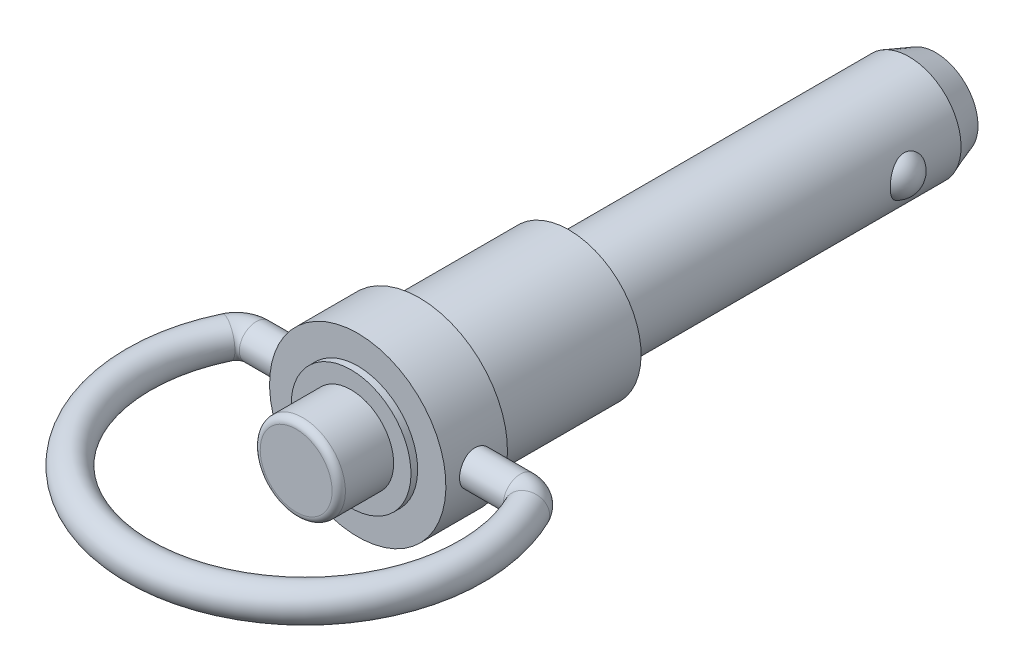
ISO-10303-21;
HEADER;
FILE_DESCRIPTION(('STEP AP214'),'2;1');
FILE_NAME('part.step','',(''),(''),'','','');
FILE_SCHEMA(('AUTOMOTIVE_DESIGN { 1 0 10303 214 1 1 1 1 }'));
ENDSEC;
DATA;
#1=APPLICATION_CONTEXT('core data for automotive mechanical design processes');
#2=APPLICATION_PROTOCOL_DEFINITION('international standard','automotive_design',2000,#1);
#3=PRODUCT_CONTEXT('',#1,'mechanical');
#4=PRODUCT('Part','Part','',(#3));
#5=PRODUCT_RELATED_PRODUCT_CATEGORY('part','',(#4));
#6=PRODUCT_DEFINITION_FORMATION('','',#4);
#7=PRODUCT_DEFINITION_CONTEXT('part definition',#1,'design');
#8=PRODUCT_DEFINITION('design','',#6,#7);
#9=PRODUCT_DEFINITION_SHAPE('','',#8);
#10=(LENGTH_UNIT() NAMED_UNIT(*) SI_UNIT(.MILLI.,.METRE.));
#11=(NAMED_UNIT(*) PLANE_ANGLE_UNIT() SI_UNIT($,.RADIAN.));
#12=(NAMED_UNIT(*) SI_UNIT($,.STERADIAN.) SOLID_ANGLE_UNIT());
#13=UNCERTAINTY_MEASURE_WITH_UNIT(LENGTH_MEASURE(1.E-05),#10,'distance_accuracy_value','');
#14=(GEOMETRIC_REPRESENTATION_CONTEXT(3) GLOBAL_UNCERTAINTY_ASSIGNED_CONTEXT((#13)) GLOBAL_UNIT_ASSIGNED_CONTEXT((#10,
#11,#12)) REPRESENTATION_CONTEXT('',''));
#15=CARTESIAN_POINT('',(0.,0.,0.));
#16=DIRECTION('',(0.,0.,1.));
#17=DIRECTION('',(1.,0.,0.));
#18=AXIS2_PLACEMENT_3D('',#15,#16,#17);
#19=CARTESIAN_POINT('',(0.,0.,20.828));
#20=DIRECTION('',(0.,0.,1.));
#21=DIRECTION('',(0.,-1.,0.));
#22=AXIS2_PLACEMENT_3D('',#19,#20,#21);
#23=PLANE('',#22);
#24=CARTESIAN_POINT('',(0.,0.,20.828));
#25=DIRECTION('',(0.,0.,-1.));
#26=DIRECTION('',(0.,1.,0.));
#27=AXIS2_PLACEMENT_3D('',#24,#25,#26);
#28=CIRCLE('',#27,2.7432);
#29=CARTESIAN_POINT('',(0.,2.7432,20.828));
#30=VERTEX_POINT('',#29);
#31=CARTESIAN_POINT('',(0.,-2.7432,20.828));
#32=VERTEX_POINT('',#31);
#33=EDGE_CURVE('E35',#30,#32,#28,.T.);
#34=ORIENTED_EDGE('',*,*,#33,.F.);
#35=CARTESIAN_POINT('',(0.,0.,20.828));
#36=DIRECTION('',(0.,0.,-1.));
#37=DIRECTION('',(0.,-1.,0.));
#38=AXIS2_PLACEMENT_3D('',#35,#36,#37);
#39=CIRCLE('',#38,2.7432);
#40=EDGE_CURVE('E28',#32,#30,#39,.T.);
#41=ORIENTED_EDGE('',*,*,#40,.F.);
#42=EDGE_LOOP('',(#34,#41));
#43=FACE_BOUND('',#42,.T.);
#44=ADVANCED_FACE('F14',(#43),#23,.T.);
#45=CARTESIAN_POINT('',(0.,0.,20.32));
#46=DIRECTION('',(0.,0.,1.));
#47=DIRECTION('',(0.,-1.,0.));
#48=AXIS2_PLACEMENT_3D('',#45,#46,#47);
#49=TOROIDAL_SURFACE('',#48,2.7432,0.508);
#50=ORIENTED_EDGE('',*,*,#40,.T.);
#51=ORIENTED_EDGE('',*,*,#33,.T.);
#52=EDGE_LOOP('',(#50,#51));
#53=FACE_BOUND('',#52,.T.);
#54=CARTESIAN_POINT('',(0.,0.,20.32));
#55=DIRECTION('',(0.,0.,-1.));
#56=DIRECTION('',(0.,1.,0.));
#57=AXIS2_PLACEMENT_3D('',#54,#55,#56);
#58=CIRCLE('',#57,3.2512);
#59=CARTESIAN_POINT('',(0.,3.2512,20.32));
#60=VERTEX_POINT('',#59);
#61=EDGE_CURVE('E114',#60,#60,#58,.T.);
#62=ORIENTED_EDGE('',*,*,#61,.F.);
#63=EDGE_LOOP('',(#62));
#64=FACE_BOUND('',#63,.T.);
#65=ADVANCED_FACE('F33',(#53,#64),#49,.T.);
#66=CARTESIAN_POINT('',(0.,0.,20.828));
#67=DIRECTION('',(0.,0.,-1.));
#68=DIRECTION('',(0.,1.,0.));
#69=AXIS2_PLACEMENT_3D('',#66,#67,#68);
#70=CYLINDRICAL_SURFACE('',#69,3.2512);
#71=CARTESIAN_POINT('',(0.,0.,16.637));
#72=DIRECTION('',(0.,0.,-1.));
#73=DIRECTION('',(0.,1.,0.));
#74=AXIS2_PLACEMENT_3D('',#71,#72,#73);
#75=CIRCLE('',#74,3.2512);
#76=CARTESIAN_POINT('',(0.,3.2512,16.637));
#77=VERTEX_POINT('',#76);
#78=EDGE_CURVE('E107',#77,#77,#75,.T.);
#79=ORIENTED_EDGE('',*,*,#78,.F.);
#80=EDGE_LOOP('',(#79));
#81=FACE_BOUND('',#80,.T.);
#82=ORIENTED_EDGE('',*,*,#61,.T.);
#83=EDGE_LOOP('',(#82));
#84=FACE_BOUND('',#83,.T.);
#85=ADVANCED_FACE('F90',(#81,#84),#70,.T.);
#86=CARTESIAN_POINT('',(4.572,0.,16.637));
#87=DIRECTION('',(0.,0.,1.));
#88=DIRECTION('',(0.,-1.,0.));
#89=AXIS2_PLACEMENT_3D('',#86,#87,#88);
#90=PLANE('',#89);
#91=ORIENTED_EDGE('',*,*,#78,.T.);
#92=EDGE_LOOP('',(#91));
#93=FACE_BOUND('',#92,.T.);
#94=CARTESIAN_POINT('',(0.,0.,16.637));
#95=DIRECTION('',(0.,0.,-1.));
#96=DIRECTION('',(0.,1.,0.));
#97=AXIS2_PLACEMENT_3D('',#94,#95,#96);
#98=CIRCLE('',#97,4.572);
#99=CARTESIAN_POINT('',(0.,4.572,16.637));
#100=VERTEX_POINT('',#99);
#101=EDGE_CURVE('E106',#100,#100,#98,.T.);
#102=ORIENTED_EDGE('',*,*,#101,.F.);
#103=EDGE_LOOP('',(#102));
#104=FACE_BOUND('',#103,.T.);
#105=ADVANCED_FACE('F93',(#93,#104),#90,.T.);
#106=CARTESIAN_POINT('',(0.,0.,0.));
#107=DIRECTION('',(0.,0.,-1.));
#108=DIRECTION('',(0.,1.,0.));
#109=AXIS2_PLACEMENT_3D('',#106,#107,#108);
#110=CYLINDRICAL_SURFACE('',#109,4.572);
#111=ORIENTED_EDGE('',*,*,#101,.T.);
#112=EDGE_LOOP('',(#111));
#113=FACE_BOUND('',#112,.T.);
#114=CARTESIAN_POINT('',(0.,0.,16.129));
#115=DIRECTION('',(0.,0.,-1.));
#116=DIRECTION('',(0.,1.,0.));
#117=AXIS2_PLACEMENT_3D('',#114,#115,#116);
#118=CIRCLE('',#117,4.572);
#119=CARTESIAN_POINT('',(0.,4.572,16.129));
#120=VERTEX_POINT('',#119);
#121=EDGE_CURVE('E134',#120,#120,#118,.T.);
#122=ORIENTED_EDGE('',*,*,#121,.F.);
#123=EDGE_LOOP('',(#122));
#124=FACE_BOUND('',#123,.T.);
#125=ADVANCED_FACE('F164',(#113,#124),#110,.T.);
#126=CARTESIAN_POINT('',(6.731,0.,16.129));
#127=DIRECTION('',(0.,0.,1.));
#128=DIRECTION('',(0.,-1.,0.));
#129=AXIS2_PLACEMENT_3D('',#126,#127,#128);
#130=PLANE('',#129);
#131=CARTESIAN_POINT('',(0.,0.,16.129));
#132=DIRECTION('',(0.,0.,-1.));
#133=DIRECTION('',(0.,1.,0.));
#134=AXIS2_PLACEMENT_3D('',#131,#132,#133);
#135=CIRCLE('',#134,6.731);
#136=CARTESIAN_POINT('',(0.,6.731,16.129));
#137=VERTEX_POINT('',#136);
#138=EDGE_CURVE('E131',#137,#137,#135,.T.);
#139=ORIENTED_EDGE('',*,*,#138,.F.);
#140=EDGE_LOOP('',(#139));
#141=FACE_BOUND('',#140,.T.);
#142=ORIENTED_EDGE('',*,*,#121,.T.);
#143=EDGE_LOOP('',(#142));
#144=FACE_BOUND('',#143,.T.);
#145=ADVANCED_FACE('F171',(#141,#144),#130,.T.);
#146=CARTESIAN_POINT('',(0.,0.,0.));
#147=DIRECTION('',(0.,0.,-1.));
#148=DIRECTION('',(0.,1.,0.));
#149=AXIS2_PLACEMENT_3D('',#146,#147,#148);
#150=CYLINDRICAL_SURFACE('',#149,6.731);
#151=CARTESIAN_POINT('',(0.,0.,11.43));
#152=DIRECTION('',(0.,0.,-1.));
#153=DIRECTION('',(0.,1.,0.));
#154=AXIS2_PLACEMENT_3D('',#151,#152,#153);
#155=CIRCLE('',#154,6.731);
#156=CARTESIAN_POINT('',(0.,6.731,11.43));
#157=VERTEX_POINT('',#156);
#158=EDGE_CURVE('E122',#157,#157,#155,.T.);
#159=ORIENTED_EDGE('',*,*,#158,.F.);
#160=EDGE_LOOP('',(#159));
#161=FACE_BOUND('',#160,.T.);
#162=ORIENTED_EDGE('',*,*,#138,.T.);
#163=EDGE_LOOP('',(#162));
#164=FACE_BOUND('',#163,.T.);
#165=CARTESIAN_POINT('',(-6.6051722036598,1.2954,13.7922));
#166=CARTESIAN_POINT('',(-6.60517361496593,1.2953972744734,13.864236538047));
#167=CARTESIAN_POINT('',(-6.60636346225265,1.28937073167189,13.9363080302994));
#168=CARTESIAN_POINT('',(-6.61098794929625,1.26544153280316,14.0784162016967));
#169=CARTESIAN_POINT('',(-6.61442445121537,1.24752902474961,14.1484511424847));
#170=CARTESIAN_POINT('',(-6.62313895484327,1.20040052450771,14.2844095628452));
#171=CARTESIAN_POINT('',(-6.62841519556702,1.17119533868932,14.3503369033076));
#172=CARTESIAN_POINT('',(-6.64021258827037,1.10233951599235,14.4763528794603));
#173=CARTESIAN_POINT('',(-6.64673365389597,1.06268960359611,14.5364419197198));
#174=CARTESIAN_POINT('',(-6.66038139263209,0.973516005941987,14.6498669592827));
#175=CARTESIAN_POINT('',(-6.66751428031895,0.9238817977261,14.7031153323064));
#176=CARTESIAN_POINT('',(-6.68152715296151,0.816387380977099,14.8005834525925));
#177=CARTESIAN_POINT('',(-6.6884071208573,0.758526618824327,14.8448025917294));
#178=CARTESIAN_POINT('',(-6.7012057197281,0.635644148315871,14.9232944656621));
#179=CARTESIAN_POINT('',(-6.70711617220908,0.570568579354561,14.9574843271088));
#180=CARTESIAN_POINT('',(-6.71724013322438,0.435464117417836,15.014412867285));
#181=CARTESIAN_POINT('',(-6.72145378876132,0.365435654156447,15.0371525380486));
#182=CARTESIAN_POINT('',(-6.72766549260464,0.223321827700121,15.0702635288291));
#183=CARTESIAN_POINT('',(-6.72968999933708,0.151272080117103,15.0807826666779));
#184=CARTESIAN_POINT('',(-6.73138656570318,0.00640388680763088,15.089614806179));
#185=CARTESIAN_POINT('',(-6.73105883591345,-0.0664144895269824,15.0879289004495));
#186=CARTESIAN_POINT('',(-6.72810846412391,-0.209738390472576,15.072511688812));
#187=CARTESIAN_POINT('',(-6.72551615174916,-0.280261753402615,15.0589395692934));
#188=CARTESIAN_POINT('',(-6.71836197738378,-0.418011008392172,15.0203872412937));
#189=CARTESIAN_POINT('',(-6.71380004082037,-0.485236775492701,14.9954066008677));
#190=CARTESIAN_POINT('',(-6.70316878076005,-0.614941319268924,14.9345963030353));
#191=CARTESIAN_POINT('',(-6.69709072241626,-0.67738974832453,14.8987035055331));
#192=CARTESIAN_POINT('',(-6.68409856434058,-0.795436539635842,14.8171343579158));
#193=CARTESIAN_POINT('',(-6.677184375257,-0.851034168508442,14.7714569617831));
#194=CARTESIAN_POINT('',(-6.66315320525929,-0.954744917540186,14.6707395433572));
#195=CARTESIAN_POINT('',(-6.65603475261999,-1.00272266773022,14.6155602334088));
#196=CARTESIAN_POINT('',(-6.64250376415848,-1.08876420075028,14.4978679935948));
#197=CARTESIAN_POINT('',(-6.63609123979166,-1.12682782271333,14.4353549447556));
#198=CARTESIAN_POINT('',(-6.62469571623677,-1.19200234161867,14.3045844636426));
#199=CARTESIAN_POINT('',(-6.61971540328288,-1.21909269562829,14.2363165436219));
#200=CARTESIAN_POINT('',(-6.61178862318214,-1.26138008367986,14.0960804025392));
#201=CARTESIAN_POINT('',(-6.60884191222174,-1.27657854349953,14.0241126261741));
#202=CARTESIAN_POINT('',(-6.60536444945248,-1.29445125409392,13.8797427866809));
#203=CARTESIAN_POINT('',(-6.60479610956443,-1.29732037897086,13.8073657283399));
#204=CARTESIAN_POINT('',(-6.60603903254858,-1.29097613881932,13.6631669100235));
#205=CARTESIAN_POINT('',(-6.60785017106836,-1.28176340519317,13.5913451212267));
#206=CARTESIAN_POINT('',(-6.6136128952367,-1.25168453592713,13.4509418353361));
#207=CARTESIAN_POINT('',(-6.61754556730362,-1.23092132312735,13.3823374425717));
#208=CARTESIAN_POINT('',(-6.62709183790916,-1.17844042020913,13.249581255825));
#209=CARTESIAN_POINT('',(-6.63270556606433,-1.14672188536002,13.1854298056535));
#210=CARTESIAN_POINT('',(-6.6450665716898,-1.07278507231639,13.0625442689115));
#211=CARTESIAN_POINT('',(-6.65182676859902,-1.03044414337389,13.0038853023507));
#212=CARTESIAN_POINT('',(-6.66568301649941,-0.936629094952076,12.8944341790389));
#213=CARTESIAN_POINT('',(-6.67277909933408,-0.885154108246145,12.8436427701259));
#214=CARTESIAN_POINT('',(-6.68662882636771,-0.773660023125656,12.7506362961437));
#215=CARTESIAN_POINT('',(-6.69337621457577,-0.713530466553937,12.7085525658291));
#216=CARTESIAN_POINT('',(-6.70566168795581,-0.586941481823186,12.6350847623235));
#217=CARTESIAN_POINT('',(-6.71119982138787,-0.520482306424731,12.6037002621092));
#218=CARTESIAN_POINT('',(-6.72041595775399,-0.383476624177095,12.5527164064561));
#219=CARTESIAN_POINT('',(-6.72410395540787,-0.312954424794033,12.5330536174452));
#220=CARTESIAN_POINT('',(-6.72924701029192,-0.169530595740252,12.5058694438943));
#221=CARTESIAN_POINT('',(-6.7307023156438,-0.0966292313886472,12.4983467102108));
#222=CARTESIAN_POINT('',(-6.73121071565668,0.0482259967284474,12.4957052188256));
#223=CARTESIAN_POINT('',(-6.73030215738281,0.120176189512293,12.5003884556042));
#224=CARTESIAN_POINT('',(-6.72626496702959,0.26224403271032,12.5215909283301));
#225=CARTESIAN_POINT('',(-6.72313635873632,0.332361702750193,12.5381100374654));
#226=CARTESIAN_POINT('',(-6.71501101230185,0.468662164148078,12.5824301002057));
#227=CARTESIAN_POINT('',(-6.710017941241,0.534852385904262,12.6102089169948));
#228=CARTESIAN_POINT('',(-6.69870305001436,0.661661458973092,12.6762356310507));
#229=CARTESIAN_POINT('',(-6.69238113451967,0.722279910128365,12.7144842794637));
#230=CARTESIAN_POINT('',(-6.6789853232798,0.837208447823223,12.8010411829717));
#231=CARTESIAN_POINT('',(-6.67190155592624,0.891410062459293,12.8494919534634));
#232=CARTESIAN_POINT('',(-6.65784127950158,0.990982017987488,12.95478313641));
#233=CARTESIAN_POINT('',(-6.65086479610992,1.03635027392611,13.0116255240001));
#234=CARTESIAN_POINT('',(-6.63773378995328,1.11738877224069,13.1327559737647));
#235=CARTESIAN_POINT('',(-6.63158802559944,1.15295925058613,13.1971117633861));
#236=CARTESIAN_POINT('',(-6.62092027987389,1.21272619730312,13.3309847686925));
#237=CARTESIAN_POINT('',(-6.61639678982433,1.23693323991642,13.4004971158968));
#238=CARTESIAN_POINT('',(-6.61041337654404,1.26845390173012,13.5238636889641));
#239=CARTESIAN_POINT('',(-6.60845980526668,1.27854107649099,13.57700269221));
#240=CARTESIAN_POINT('',(-6.60583870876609,1.29201504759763,13.6841545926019));
#241=CARTESIAN_POINT('',(-6.60517114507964,1.29540204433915,13.7381674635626));
#242=CARTESIAN_POINT('',(-6.6051722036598,1.2954,13.7922));
#243=B_SPLINE_CURVE_WITH_KNOTS('',3,(#165,#166,#167,#168,#169,#170,#171,#172,#173,#174,#175,
#176,#177,#178,#179,#180,#181,#182,#183,#184,#185,#186,#187,#188,#189,#190,#191,#192,#193,#194,
#195,#196,#197,#198,#199,#200,#201,#202,#203,#204,#205,#206,#207,#208,#209,#210,#211,#212,#213,
#214,#215,#216,#217,#218,#219,#220,#221,#222,#223,#224,#225,#226,#227,#228,#229,#230,#231,#232,
#233,#234,#235,#236,#237,#238,#239,#240,#241,#242),.UNSPECIFIED.,.T.,.F.,(4,2,2,2,2,2,2,2,2,2,2,
2,2,2,2,2,2,2,2,2,2,2,2,2,2,2,2,2,2,2,2,2,2,2,2,2,2,2,4),(0.,0.215911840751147,
0.432002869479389,0.64788762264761,0.86375740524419,1.08216318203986,1.30058366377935,
1.52076118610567,1.74091962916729,1.95838638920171,2.1758336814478,2.39041258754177,
2.60499961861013,2.82085272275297,3.0367289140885,3.25609136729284,3.47545737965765,
3.69523218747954,3.91498064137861,4.13124273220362,4.34749352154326,4.56184753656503,
4.7762180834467,4.99318797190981,5.21017847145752,5.430235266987,5.65028327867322,
5.86912939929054,6.08795119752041,6.30324544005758,6.51853737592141,6.73340808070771,
6.94829420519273,7.16640910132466,7.38457541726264,7.60488731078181,7.82499378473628,
7.9869478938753,8.14889715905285),.UNSPECIFIED.);
#244=CARTESIAN_POINT('',(-6.6051722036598,1.2954,13.7922));
#245=VERTEX_POINT('',#244);
#246=EDGE_CURVE('E332',#245,#245,#243,.T.);
#247=ORIENTED_EDGE('',*,*,#246,.T.);
#248=EDGE_LOOP('',(#247));
#249=FACE_BOUND('',#248,.T.);
#250=CARTESIAN_POINT('',(6.6051722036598,1.2954,13.7922));
#251=CARTESIAN_POINT('',(6.60517361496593,1.2953972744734,13.720163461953));
#252=CARTESIAN_POINT('',(6.60636346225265,1.2893707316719,13.6480919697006));
#253=CARTESIAN_POINT('',(6.61098794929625,1.26544153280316,13.5059837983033));
#254=CARTESIAN_POINT('',(6.61442445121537,1.24752902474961,13.4359488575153));
#255=CARTESIAN_POINT('',(6.62313895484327,1.20040052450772,13.2999904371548));
#256=CARTESIAN_POINT('',(6.62841519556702,1.17119533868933,13.2340630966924));
#257=CARTESIAN_POINT('',(6.64021258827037,1.10233951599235,13.1080471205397));
#258=CARTESIAN_POINT('',(6.64673365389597,1.06268960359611,13.0479580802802));
#259=CARTESIAN_POINT('',(6.66038139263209,0.973516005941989,12.9345330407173));
#260=CARTESIAN_POINT('',(6.66751428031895,0.923881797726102,12.8812846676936));
#261=CARTESIAN_POINT('',(6.68152715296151,0.816387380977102,12.7838165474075));
#262=CARTESIAN_POINT('',(6.6884071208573,0.758526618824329,12.7395974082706));
#263=CARTESIAN_POINT('',(6.7012057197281,0.635644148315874,12.6611055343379));
#264=CARTESIAN_POINT('',(6.70711617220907,0.570568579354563,12.6269156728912));
#265=CARTESIAN_POINT('',(6.71724013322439,0.435464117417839,12.569987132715));
#266=CARTESIAN_POINT('',(6.72145378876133,0.36543565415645,12.5472474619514));
#267=CARTESIAN_POINT('',(6.72766549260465,0.223321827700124,12.5141364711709));
#268=CARTESIAN_POINT('',(6.72968999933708,0.151272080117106,12.5036173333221));
#269=CARTESIAN_POINT('',(6.73138656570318,0.00640388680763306,12.494785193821));
#270=CARTESIAN_POINT('',(6.73105883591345,-0.0664144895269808,12.4964710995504));
#271=CARTESIAN_POINT('',(6.72810846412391,-0.209738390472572,12.511888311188));
#272=CARTESIAN_POINT('',(6.72551615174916,-0.280261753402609,12.5254604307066));
#273=CARTESIAN_POINT('',(6.71836197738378,-0.418011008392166,12.5640127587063));
#274=CARTESIAN_POINT('',(6.71380004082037,-0.4852367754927,12.5889933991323));
#275=CARTESIAN_POINT('',(6.70316878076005,-0.614941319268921,12.6498036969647));
#276=CARTESIAN_POINT('',(6.69709072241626,-0.67738974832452,12.6856964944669));
#277=CARTESIAN_POINT('',(6.68409856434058,-0.795436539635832,12.7672656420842));
#278=CARTESIAN_POINT('',(6.677184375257,-0.851034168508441,12.8129430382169));
#279=CARTESIAN_POINT('',(6.66315320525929,-0.954744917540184,12.9136604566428));
#280=CARTESIAN_POINT('',(6.65603475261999,-1.00272266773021,12.9688397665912));
#281=CARTESIAN_POINT('',(6.64250376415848,-1.08876420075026,13.0865320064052));
#282=CARTESIAN_POINT('',(6.63609123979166,-1.12682782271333,13.1490450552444));
#283=CARTESIAN_POINT('',(6.62469571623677,-1.19200234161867,13.2798155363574));
#284=CARTESIAN_POINT('',(6.61971540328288,-1.21909269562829,13.3480834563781));
#285=CARTESIAN_POINT('',(6.61178862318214,-1.26138008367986,13.4883195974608));
#286=CARTESIAN_POINT('',(6.60884191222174,-1.27657854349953,13.5602873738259));
#287=CARTESIAN_POINT('',(6.60536444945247,-1.29445125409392,13.7046572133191));
#288=CARTESIAN_POINT('',(6.60479610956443,-1.29732037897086,13.7770342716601));
#289=CARTESIAN_POINT('',(6.60603903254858,-1.29097613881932,13.9212330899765));
#290=CARTESIAN_POINT('',(6.60785017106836,-1.28176340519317,13.9930548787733));
#291=CARTESIAN_POINT('',(6.6136128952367,-1.25168453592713,14.1334581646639));
#292=CARTESIAN_POINT('',(6.61754556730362,-1.23092132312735,14.2020625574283));
#293=CARTESIAN_POINT('',(6.62709183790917,-1.17844042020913,14.334818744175));
#294=CARTESIAN_POINT('',(6.63270556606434,-1.14672188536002,14.3989701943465));
#295=CARTESIAN_POINT('',(6.64506657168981,-1.07278507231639,14.5218557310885));
#296=CARTESIAN_POINT('',(6.65182676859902,-1.03044414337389,14.5805146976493));
#297=CARTESIAN_POINT('',(6.66568301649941,-0.936629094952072,14.6899658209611));
#298=CARTESIAN_POINT('',(6.67277909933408,-0.885154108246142,14.7407572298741));
#299=CARTESIAN_POINT('',(6.68662882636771,-0.773660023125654,14.8337637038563));
#300=CARTESIAN_POINT('',(6.69337621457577,-0.713530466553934,14.8758474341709));
#301=CARTESIAN_POINT('',(6.70566168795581,-0.586941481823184,14.9493152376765));
#302=CARTESIAN_POINT('',(6.71119982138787,-0.520482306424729,14.9806997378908));
#303=CARTESIAN_POINT('',(6.72041595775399,-0.383476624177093,15.0316835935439));
#304=CARTESIAN_POINT('',(6.72410395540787,-0.31295442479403,15.0513463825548));
#305=CARTESIAN_POINT('',(6.72924701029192,-0.169530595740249,15.0785305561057));
#306=CARTESIAN_POINT('',(6.7307023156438,-0.0966292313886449,15.0860532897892));
#307=CARTESIAN_POINT('',(6.73121071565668,0.0482259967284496,15.0886947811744));
#308=CARTESIAN_POINT('',(6.73030215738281,0.120176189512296,15.0840115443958));
#309=CARTESIAN_POINT('',(6.72626496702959,0.262244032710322,15.0628090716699));
#310=CARTESIAN_POINT('',(6.72313635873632,0.332361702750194,15.0462899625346));
#311=CARTESIAN_POINT('',(6.71501101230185,0.46866216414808,15.0019698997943));
#312=CARTESIAN_POINT('',(6.710017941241,0.534852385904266,14.9741910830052));
#313=CARTESIAN_POINT('',(6.69870305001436,0.661661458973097,14.9081643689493));
#314=CARTESIAN_POINT('',(6.69238113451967,0.722279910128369,14.8699157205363));
#315=CARTESIAN_POINT('',(6.6789853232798,0.837208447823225,14.7833588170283));
#316=CARTESIAN_POINT('',(6.67190155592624,0.891410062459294,14.7349080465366));
#317=CARTESIAN_POINT('',(6.65784127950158,0.990982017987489,14.62961686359));
#318=CARTESIAN_POINT('',(6.65086479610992,1.03635027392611,14.5727744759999));
#319=CARTESIAN_POINT('',(6.63773378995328,1.1173887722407,14.4516440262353));
#320=CARTESIAN_POINT('',(6.63158802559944,1.15295925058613,14.3872882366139));
#321=CARTESIAN_POINT('',(6.62092027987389,1.21272619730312,14.2534152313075));
#322=CARTESIAN_POINT('',(6.61639678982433,1.23693323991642,14.1839028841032));
#323=CARTESIAN_POINT('',(6.61041337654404,1.26845390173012,14.0605363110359));
#324=CARTESIAN_POINT('',(6.60845980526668,1.27854107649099,14.00739730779));
#325=CARTESIAN_POINT('',(6.60583870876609,1.29201504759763,13.9002454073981));
#326=CARTESIAN_POINT('',(6.60517114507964,1.29540204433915,13.8462325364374));
#327=CARTESIAN_POINT('',(6.6051722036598,1.2954,13.7922));
#328=B_SPLINE_CURVE_WITH_KNOTS('',3,(#250,#251,#252,#253,#254,#255,#256,#257,#258,#259,#260,
#261,#262,#263,#264,#265,#266,#267,#268,#269,#270,#271,#272,#273,#274,#275,#276,#277,#278,#279,
#280,#281,#282,#283,#284,#285,#286,#287,#288,#289,#290,#291,#292,#293,#294,#295,#296,#297,#298,
#299,#300,#301,#302,#303,#304,#305,#306,#307,#308,#309,#310,#311,#312,#313,#314,#315,#316,#317,
#318,#319,#320,#321,#322,#323,#324,#325,#326,#327),.UNSPECIFIED.,.T.,.F.,(4,2,2,2,2,2,2,2,2,2,2,
2,2,2,2,2,2,2,2,2,2,2,2,2,2,2,2,2,2,2,2,2,2,2,2,2,2,2,4),(0.,0.215911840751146,
0.432002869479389,0.64788762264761,0.86375740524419,1.08216318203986,1.30058366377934,
1.52076118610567,1.74091962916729,1.95838638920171,2.1758336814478,2.39041258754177,
2.60499961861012,2.82085272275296,3.0367289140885,3.25609136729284,3.47545737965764,
3.69523218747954,3.91498064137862,4.13124273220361,4.34749352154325,4.56184753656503,
4.77621808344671,4.99318797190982,5.21017847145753,5.43023526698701,5.65028327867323,
5.86912939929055,6.08795119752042,6.30324544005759,6.51853737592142,6.73340808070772,
6.94829420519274,7.16640910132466,7.38457541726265,7.60488731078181,7.82499378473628,
7.98694789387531,8.14889715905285),.UNSPECIFIED.);
#329=CARTESIAN_POINT('',(6.6051722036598,1.2954,13.7922));
#330=VERTEX_POINT('',#329);
#331=EDGE_CURVE('E330',#330,#330,#328,.T.);
#332=ORIENTED_EDGE('',*,*,#331,.T.);
#333=EDGE_LOOP('',(#332));
#334=FACE_BOUND('',#333,.T.);
#335=ADVANCED_FACE('F180',(#161,#164,#249,#334),#150,.T.);
#336=CARTESIAN_POINT('',(5.7785,0.,11.43));
#337=DIRECTION('',(0.,0.,-1.));
#338=DIRECTION('',(0.,1.,0.));
#339=AXIS2_PLACEMENT_3D('',#336,#337,#338);
#340=PLANE('',#339);
#341=CARTESIAN_POINT('',(0.,0.,11.43));
#342=DIRECTION('',(0.,0.,-1.));
#343=DIRECTION('',(0.,1.,0.));
#344=AXIS2_PLACEMENT_3D('',#341,#342,#343);
#345=CIRCLE('',#344,5.9);
#346=CARTESIAN_POINT('',(0.,5.9,11.43));
#347=VERTEX_POINT('',#346);
#348=EDGE_CURVE('E22',#347,#347,#345,.F.);
#349=ORIENTED_EDGE('',*,*,#348,.T.);
#350=EDGE_LOOP('',(#349));
#351=FACE_BOUND('',#350,.T.);
#352=ORIENTED_EDGE('',*,*,#158,.T.);
#353=EDGE_LOOP('',(#352));
#354=FACE_BOUND('',#353,.T.);
#355=ADVANCED_FACE('F88',(#351,#354),#340,.T.);
#356=CARTESIAN_POINT('',(10.0803124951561,0.,15.3162));
#357=DIRECTION('',(0.,1.,0.));
#358=DIRECTION('',(-1.,0.,0.));
#359=AXIS2_PLACEMENT_3D('',#356,#357,#358);
#360=TOROIDAL_SURFACE('',#359,1.524,1.2954);
#361=CARTESIAN_POINT('',(11.4549005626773,0.,14.658109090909));
#362=DIRECTION('',(-0.431818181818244,0.,-0.901960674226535));
#363=DIRECTION('',(0.901960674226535,0.,-0.431818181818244));
#364=AXIS2_PLACEMENT_3D('',#361,#362,#363);
#365=CIRCLE('',#364,1.2954);
#366=CARTESIAN_POINT('',(12.6233004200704,0.,14.0987318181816));
#367=VERTEX_POINT('',#366);
#368=EDGE_CURVE('E41',#367,#367,#365,.T.);
#369=ORIENTED_EDGE('',*,*,#368,.T.);
#370=EDGE_LOOP('',(#369));
#371=FACE_BOUND('',#370,.T.);
#372=CARTESIAN_POINT('',(10.0803124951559,0.,13.7922));
#373=DIRECTION('',(1.,0.,0.));
#374=DIRECTION('',(0.,1.,0.));
#375=AXIS2_PLACEMENT_3D('',#372,#373,#374);
#376=CIRCLE('',#375,1.2954);
#377=CARTESIAN_POINT('',(10.0803124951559,1.2954,13.7922));
#378=VERTEX_POINT('',#377);
#379=EDGE_CURVE('E108',#378,#378,#376,.F.);
#380=ORIENTED_EDGE('',*,*,#379,.F.);
#381=EDGE_LOOP('',(#380));
#382=FACE_BOUND('',#381,.T.);
#383=ADVANCED_FACE('F85',(#371,#382),#360,.T.);
#384=CARTESIAN_POINT('',(-10.0803124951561,0.,13.7922));
#385=DIRECTION('',(1.,0.,0.));
#386=DIRECTION('',(0.,1.,0.));
#387=AXIS2_PLACEMENT_3D('',#384,#385,#386);
#388=CYLINDRICAL_SURFACE('',#387,1.2954);
#389=ORIENTED_EDGE('',*,*,#331,.F.);
#390=EDGE_LOOP('',(#389));
#391=FACE_BOUND('',#390,.T.);
#392=ORIENTED_EDGE('',*,*,#379,.T.);
#393=EDGE_LOOP('',(#392));
#394=FACE_BOUND('',#393,.T.);
#395=ADVANCED_FACE('F83',(#391,#394),#388,.T.);
#396=CARTESIAN_POINT('',(0.,0.,20.1422));
#397=DIRECTION('',(0.,1.,0.));
#398=DIRECTION('',(-1.,0.,0.));
#399=AXIS2_PLACEMENT_3D('',#396,#397,#398);
#400=TOROIDAL_SURFACE('',#399,12.7,1.2954);
#401=CARTESIAN_POINT('',(-11.4549005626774,0.,14.658109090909));
#402=DIRECTION('',(-0.43181818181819,0.,0.901960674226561));
#403=DIRECTION('',(-0.901960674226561,0.,-0.43181818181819));
#404=AXIS2_PLACEMENT_3D('',#401,#402,#403);
#405=CIRCLE('',#404,1.2954);
#406=CARTESIAN_POINT('',(-12.6233004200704,0.,14.0987318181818));
#407=VERTEX_POINT('',#406);
#408=EDGE_CURVE('E111',#407,#407,#405,.F.);
#409=ORIENTED_EDGE('',*,*,#408,.F.);
#410=EDGE_LOOP('',(#409));
#411=FACE_BOUND('',#410,.T.);
#412=ORIENTED_EDGE('',*,*,#368,.F.);
#413=EDGE_LOOP('',(#412));
#414=FACE_BOUND('',#413,.T.);
#415=ADVANCED_FACE('F79',(#411,#414),#400,.T.);
#416=CARTESIAN_POINT('',(-10.0803124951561,0.,15.3162));
#417=DIRECTION('',(0.,1.,0.));
#418=DIRECTION('',(-1.,0.,0.));
#419=AXIS2_PLACEMENT_3D('',#416,#417,#418);
#420=TOROIDAL_SURFACE('',#419,1.524,1.2954);
#421=CARTESIAN_POINT('',(-10.0803124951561,0.,13.7922));
#422=DIRECTION('',(1.,0.,0.));
#423=DIRECTION('',(0.,1.,0.));
#424=AXIS2_PLACEMENT_3D('',#421,#422,#423);
#425=CIRCLE('',#424,1.2954);
#426=CARTESIAN_POINT('',(-10.0803124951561,1.2954,13.7922));
#427=VERTEX_POINT('',#426);
#428=EDGE_CURVE('E103',#427,#427,#425,.T.);
#429=ORIENTED_EDGE('',*,*,#428,.F.);
#430=EDGE_LOOP('',(#429));
#431=FACE_BOUND('',#430,.T.);
#432=ORIENTED_EDGE('',*,*,#408,.T.);
#433=EDGE_LOOP('',(#432));
#434=FACE_BOUND('',#433,.T.);
#435=ADVANCED_FACE('F82',(#431,#434),#420,.T.);
#436=CARTESIAN_POINT('',(-10.0803124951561,0.,13.7922));
#437=DIRECTION('',(1.,0.,0.));
#438=DIRECTION('',(0.,1.,0.));
#439=AXIS2_PLACEMENT_3D('',#436,#437,#438);
#440=CYLINDRICAL_SURFACE('',#439,1.2954);
#441=ORIENTED_EDGE('',*,*,#246,.F.);
#442=EDGE_LOOP('',(#441));
#443=FACE_BOUND('',#442,.T.);
#444=ORIENTED_EDGE('',*,*,#428,.T.);
#445=EDGE_LOOP('',(#444));
#446=FACE_BOUND('',#445,.T.);
#447=ADVANCED_FACE('F97',(#443,#446),#440,.T.);
#448=CARTESIAN_POINT('',(0.,0.,39.3696462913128));
#449=DIRECTION('',(0.,0.,-1.));
#450=DIRECTION('',(0.,1.,0.));
#451=AXIS2_PLACEMENT_3D('',#448,#449,#450);
#452=CYLINDRICAL_SURFACE('',#451,5.5);
#453=CARTESIAN_POINT('',(0.,0.,11.03));
#454=DIRECTION('',(0.,0.,-1.));
#455=DIRECTION('',(0.,1.,0.));
#456=AXIS2_PLACEMENT_3D('',#453,#454,#455);
#457=CIRCLE('',#456,5.5);
#458=CARTESIAN_POINT('',(0.,5.5,11.03));
#459=VERTEX_POINT('',#458);
#460=EDGE_CURVE('E9',#459,#459,#457,.T.);
#461=ORIENTED_EDGE('',*,*,#460,.T.);
#462=EDGE_LOOP('',(#461));
#463=FACE_BOUND('',#462,.T.);
#464=CARTESIAN_POINT('',(0.,0.,0.));
#465=DIRECTION('',(0.,0.,-1.));
#466=DIRECTION('',(0.,1.,0.));
#467=AXIS2_PLACEMENT_3D('',#464,#465,#466);
#468=CIRCLE('',#467,5.5);
#469=CARTESIAN_POINT('',(0.,5.5,0.));
#470=VERTEX_POINT('',#469);
#471=EDGE_CURVE('E378',#470,#470,#468,.T.);
#472=ORIENTED_EDGE('',*,*,#471,.F.);
#473=EDGE_LOOP('',(#472));
#474=FACE_BOUND('',#473,.T.);
#475=ADVANCED_FACE('F227',(#463,#474),#452,.T.);
#476=CARTESIAN_POINT('',(3.22979748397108,0.,-27.9908));
#477=DIRECTION('',(0.,0.,1.));
#478=DIRECTION('',(0.,-1.,0.));
#479=AXIS2_PLACEMENT_3D('',#476,#477,#478);
#480=PLANE('',#479);
#481=CARTESIAN_POINT('',(0.,0.,-27.9907999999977));
#482=DIRECTION('',(0.,0.,1.));
#483=DIRECTION('',(0.,-1.,0.));
#484=AXIS2_PLACEMENT_3D('',#481,#482,#483);
#485=CIRCLE('',#484,3.22979748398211);
#486=CARTESIAN_POINT('',(0.,-3.22979748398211,-27.9907999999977));
#487=VERTEX_POINT('',#486);
#488=EDGE_CURVE('E44',#487,#487,#485,.T.);
#489=ORIENTED_EDGE('',*,*,#488,.F.);
#490=EDGE_LOOP('',(#489));
#491=FACE_BOUND('',#490,.T.);
#492=ADVANCED_FACE('F236',(#491),#480,.F.);
#493=CARTESIAN_POINT('',(3.12293,0.,-21.8948));
#494=DIRECTION('',(0.,0.,1.));
#495=DIRECTION('',(1.,0.,0.));
#496=AXIS2_PLACEMENT_3D('',#493,#494,#495);
#497=SPHERICAL_SURFACE('',#496,1.5875);
#498=CARTESIAN_POINT('',(3.969385,0.,-20.5517921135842));
#499=CARTESIAN_POINT('',(3.96938133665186,0.0871787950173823,-20.5517940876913));
#500=CARTESIAN_POINT('',(3.96648576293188,0.174428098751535,-20.5584820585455));
#501=CARTESIAN_POINT('',(3.95516905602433,0.346584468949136,-20.5851998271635));
#502=CARTESIAN_POINT('',(3.94674017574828,0.431488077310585,-20.6052483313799));
#503=CARTESIAN_POINT('',(3.92519423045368,0.596479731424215,-20.6585272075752));
#504=CARTESIAN_POINT('',(3.91207555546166,0.67656611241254,-20.6917621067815));
#505=CARTESIAN_POINT('',(3.88253654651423,0.829452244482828,-20.7710588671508));
#506=CARTESIAN_POINT('',(3.86611699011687,0.902253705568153,-20.8171177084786));
#507=CARTESIAN_POINT('',(3.83222363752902,1.03672093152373,-20.9203356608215));
#508=CARTESIAN_POINT('',(3.81477966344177,1.0985904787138,-20.9772380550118));
#509=CARTESIAN_POINT('',(3.78068495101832,1.21073548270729,-21.1017462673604));
#510=CARTESIAN_POINT('',(3.76403384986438,1.26101628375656,-21.1693471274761));
#511=CARTESIAN_POINT('',(3.73507217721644,1.34426479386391,-21.3077911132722));
#512=CARTESIAN_POINT('',(3.72252093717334,1.37829571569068,-21.3779422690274));
#513=CARTESIAN_POINT('',(3.70178973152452,1.43305274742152,-21.5238520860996));
#514=CARTESIAN_POINT('',(3.69360549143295,1.45379187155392,-21.5996051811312));
#515=CARTESIAN_POINT('',(3.68341966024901,1.47939277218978,-21.7454817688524));
#516=CARTESIAN_POINT('',(3.680835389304,1.4857542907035,-21.8153038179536));
#517=CARTESIAN_POINT('',(3.68040725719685,1.48681628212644,-21.9550414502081));
#518=CARTESIAN_POINT('',(3.68256179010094,1.48152070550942,-22.0249569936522));
#519=CARTESIAN_POINT('',(3.69108766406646,1.4601393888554,-22.1588086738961));
#520=CARTESIAN_POINT('',(3.69721728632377,1.44467149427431,-22.2228608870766));
#521=CARTESIAN_POINT('',(3.71278611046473,1.40417367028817,-22.3474287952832));
#522=CARTESIAN_POINT('',(3.72222570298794,1.37914261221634,-22.4079440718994));
#523=CARTESIAN_POINT('',(3.74389633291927,1.3192072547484,-22.5264268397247));
#524=CARTESIAN_POINT('',(3.75622345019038,1.28394990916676,-22.5841973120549));
#525=CARTESIAN_POINT('',(3.78224213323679,1.2051474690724,-22.6934181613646));
#526=CARTESIAN_POINT('',(3.79593412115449,1.1615998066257,-22.7448665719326));
#527=CARTESIAN_POINT('',(3.82484228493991,1.06277839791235,-22.8454045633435));
#528=CARTESIAN_POINT('',(3.84007638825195,1.0067738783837,-22.8937694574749));
#529=CARTESIAN_POINT('',(3.86933265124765,0.887713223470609,-22.9813922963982));
#530=CARTESIAN_POINT('',(3.88335410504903,0.82465302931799,-23.0206449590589));
#531=CARTESIAN_POINT('',(3.90318345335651,0.722863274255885,-23.0740110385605));
#532=CARTESIAN_POINT('',(3.90984058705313,0.686009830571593,-23.0914710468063));
#533=CARTESIAN_POINT('',(3.92226926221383,0.610957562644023,-23.123476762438));
#534=CARTESIAN_POINT('',(3.92804156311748,0.572759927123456,-23.1380249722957));
#535=CARTESIAN_POINT('',(3.94381689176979,0.456514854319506,-23.1772484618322));
#536=CARTESIAN_POINT('',(3.95229851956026,0.376714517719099,-23.197554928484));
#537=CARTESIAN_POINT('',(3.96199329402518,0.247044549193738,-23.2205332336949));
#538=CARTESIAN_POINT('',(3.96475587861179,0.197910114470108,-23.2270073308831));
#539=CARTESIAN_POINT('',(3.96845279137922,0.0991914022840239,-23.2356452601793));
#540=CARTESIAN_POINT('',(3.96938708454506,0.049607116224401,-23.2378090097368));
#541=CARTESIAN_POINT('',(3.96938133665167,-0.0871787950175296,-23.2378059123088));
#542=CARTESIAN_POINT('',(3.96648576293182,-0.174428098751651,-23.2311179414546));
#543=CARTESIAN_POINT('',(3.95516905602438,-0.346584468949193,-23.2044001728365));
#544=CARTESIAN_POINT('',(3.94674017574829,-0.431488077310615,-23.18435166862));
#545=CARTESIAN_POINT('',(3.92519423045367,-0.596479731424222,-23.1310727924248));
#546=CARTESIAN_POINT('',(3.91207555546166,-0.676566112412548,-23.0978378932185));
#547=CARTESIAN_POINT('',(3.88253654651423,-0.829452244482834,-23.0185411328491));
#548=CARTESIAN_POINT('',(3.86611699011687,-0.902253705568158,-22.9724822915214));
#549=CARTESIAN_POINT('',(3.83222363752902,-1.03672093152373,-22.8692643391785));
#550=CARTESIAN_POINT('',(3.81477966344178,-1.0985904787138,-22.8123619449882));
#551=CARTESIAN_POINT('',(3.78068495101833,-1.21073548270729,-22.6878537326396));
#552=CARTESIAN_POINT('',(3.76403384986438,-1.26101628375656,-22.6202528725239));
#553=CARTESIAN_POINT('',(3.73507217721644,-1.34426479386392,-22.4818088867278));
#554=CARTESIAN_POINT('',(3.72252093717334,-1.37829571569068,-22.4116577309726));
#555=CARTESIAN_POINT('',(3.70178973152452,-1.43305274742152,-22.2657479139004));
#556=CARTESIAN_POINT('',(3.69360549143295,-1.45379187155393,-22.1899948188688));
#557=CARTESIAN_POINT('',(3.68341966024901,-1.47939277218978,-22.0441182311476));
#558=CARTESIAN_POINT('',(3.680835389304,-1.4857542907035,-21.9742961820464));
#559=CARTESIAN_POINT('',(3.68040725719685,-1.48681628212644,-21.8345585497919));
#560=CARTESIAN_POINT('',(3.68256179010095,-1.48152070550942,-21.7646430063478));
#561=CARTESIAN_POINT('',(3.69108766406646,-1.46013938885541,-21.6307913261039));
#562=CARTESIAN_POINT('',(3.69721728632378,-1.44467149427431,-21.5667391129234));
#563=CARTESIAN_POINT('',(3.71278611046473,-1.40417367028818,-21.4421712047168));
#564=CARTESIAN_POINT('',(3.72222570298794,-1.37914261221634,-21.3816559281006));
#565=CARTESIAN_POINT('',(3.74389633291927,-1.3192072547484,-21.2631731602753));
#566=CARTESIAN_POINT('',(3.75622345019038,-1.28394990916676,-21.2054026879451));
#567=CARTESIAN_POINT('',(3.78224213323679,-1.20514746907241,-21.0961818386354));
#568=CARTESIAN_POINT('',(3.79593412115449,-1.16159980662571,-21.0447334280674));
#569=CARTESIAN_POINT('',(3.82484228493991,-1.06277839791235,-20.9441954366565));
#570=CARTESIAN_POINT('',(3.84007638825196,-1.00677387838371,-20.895830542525));
#571=CARTESIAN_POINT('',(3.86933265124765,-0.887713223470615,-20.8082077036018));
#572=CARTESIAN_POINT('',(3.88335410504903,-0.824653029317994,-20.7689550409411));
#573=CARTESIAN_POINT('',(3.90318345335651,-0.722863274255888,-20.7155889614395));
#574=CARTESIAN_POINT('',(3.90984058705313,-0.686009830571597,-20.6981289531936));
#575=CARTESIAN_POINT('',(3.92226926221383,-0.610957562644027,-20.666123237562));
#576=CARTESIAN_POINT('',(3.92804156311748,-0.57275992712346,-20.6515750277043));
#577=CARTESIAN_POINT('',(3.94381689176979,-0.456514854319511,-20.6123515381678));
#578=CARTESIAN_POINT('',(3.95229851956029,-0.376714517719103,-20.592045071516));
#579=CARTESIAN_POINT('',(3.96199329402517,-0.247044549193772,-20.5690667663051));
#580=CARTESIAN_POINT('',(3.96475587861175,-0.197910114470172,-20.5625926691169));
#581=CARTESIAN_POINT('',(3.96845279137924,-0.0991914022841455,-20.5539547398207));
#582=CARTESIAN_POINT('',(3.96938708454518,-0.0496071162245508,-20.5517909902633));
#583=CARTESIAN_POINT('',(3.969385,0.,-20.5517921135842));
#584=B_SPLINE_CURVE_WITH_KNOTS('',3,(#498,#499,#500,#501,#502,#503,#504,#505,#506,#507,#508,
#509,#510,#511,#512,#513,#514,#515,#516,#517,#518,#519,#520,#521,#522,#523,#524,#525,#526,#527,
#528,#529,#530,#531,#532,#533,#534,#535,#536,#537,#538,#539,#540,#541,#542,#543,#544,#545,#546,
#547,#548,#549,#550,#551,#552,#553,#554,#555,#556,#557,#558,#559,#560,#561,#562,#563,#564,#565,
#566,#567,#568,#569,#570,#571,#572,#573,#574,#575,#576,#577,#578,#579,#580,#581,#582,#583),
.UNSPECIFIED.,.T.,.F.,(4,2,2,2,2,2,2,2,2,2,2,2,2,2,2,2,2,2,2,2,2,2,2,2,2,2,2,2,2,2,2,2,2,2,2,2,
2,2,2,2,2,2,4),(0.,0.261355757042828,0.523078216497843,0.784890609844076,1.04664140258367,
1.30282923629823,1.55889868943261,1.79448362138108,2.02983753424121,2.23921556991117,
2.44852266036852,2.64616391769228,2.84382850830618,3.04935366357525,3.25494258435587,
3.4806694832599,3.70652690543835,3.83036514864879,3.95409650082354,4.20121716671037,
4.34993288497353,4.49865145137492,4.76000720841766,5.0217296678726,5.28354206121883,
5.54529285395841,5.80148068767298,6.05755014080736,6.29313507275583,6.52848898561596,
6.73786702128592,6.94717411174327,7.14481536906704,7.34247995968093,7.54800511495,
7.75359403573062,7.97932093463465,8.2051783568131,8.32901660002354,8.4527479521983,
8.69986861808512,8.8485843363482,8.9973029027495),.UNSPECIFIED.);
#585=CARTESIAN_POINT('',(3.969385,0.,-20.5517921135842));
#586=VERTEX_POINT('',#585);
#587=EDGE_CURVE('E369',#586,#586,#584,.T.);
#588=ORIENTED_EDGE('',*,*,#587,.F.);
#589=EDGE_LOOP('',(#588));
#590=FACE_BOUND('',#589,.T.);
#591=ADVANCED_FACE('F245',(#590),#497,.T.);
#592=CARTESIAN_POINT('',(-3.12207,0.,-21.8948));
#593=DIRECTION('',(0.,0.,1.));
#594=DIRECTION('',(1.,0.,0.));
#595=AXIS2_PLACEMENT_3D('',#592,#593,#594);
#596=SPHERICAL_SURFACE('',#595,1.5875);
#597=CARTESIAN_POINT('',(-3.969385,0.,-23.2372654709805));
#598=CARTESIAN_POINT('',(-3.96938133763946,0.0871655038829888,-23.2372634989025));
#599=CARTESIAN_POINT('',(-3.96648664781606,0.174401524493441,-23.2305767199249));
#600=CARTESIAN_POINT('',(-3.95517337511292,0.346531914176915,-23.2038635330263));
#601=CARTESIAN_POINT('',(-3.94674704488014,0.431422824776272,-23.1838184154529));
#602=CARTESIAN_POINT('',(-3.92520757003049,0.596390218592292,-23.130547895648));
#603=CARTESIAN_POINT('',(-3.91209280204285,0.676465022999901,-23.0973179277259));
#604=CARTESIAN_POINT('',(-3.88256269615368,0.829328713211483,-23.0180318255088));
#605=CARTESIAN_POINT('',(-3.86614813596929,0.902119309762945,-22.9719787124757));
#606=CARTESIAN_POINT('',(-3.83226668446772,1.03656073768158,-22.8687753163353));
#607=CARTESIAN_POINT('',(-3.81482968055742,1.09841593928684,-22.8118824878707));
#608=CARTESIAN_POINT('',(-3.78074977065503,1.2105322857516,-22.6873942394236));
#609=CARTESIAN_POINT('',(-3.76410650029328,1.26079879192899,-22.6198037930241));
#610=CARTESIAN_POINT('',(-3.73516296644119,1.3440117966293,-22.4813917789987));
#611=CARTESIAN_POINT('',(-3.72262152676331,1.37802358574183,-22.4112633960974));
#612=CARTESIAN_POINT('',(-3.70190880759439,1.43274470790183,-22.2654021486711));
#613=CARTESIAN_POINT('',(-3.69373324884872,1.45346707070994,-22.1896748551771));
#614=CARTESIAN_POINT('',(-3.68356253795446,1.47903682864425,-22.0438593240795));
#615=CARTESIAN_POINT('',(-3.6809843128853,1.48538528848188,-21.974072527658));
#616=CARTESIAN_POINT('',(-3.68056466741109,1.48642656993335,-21.8344074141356));
#617=CARTESIAN_POINT('',(-3.68272164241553,1.48112333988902,-21.764529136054));
#618=CARTESIAN_POINT('',(-3.69124841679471,1.45973298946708,-21.6307514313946));
#619=CARTESIAN_POINT('',(-3.69737666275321,1.44426351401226,-21.5667358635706));
#620=CARTESIAN_POINT('',(-3.71293936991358,1.40376833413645,-21.442240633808));
#621=CARTESIAN_POINT('',(-3.7223742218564,1.37874150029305,-21.3817613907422));
#622=CARTESIAN_POINT('',(-3.74403310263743,1.31881886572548,-21.2633463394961));
#623=CARTESIAN_POINT('',(-3.75635326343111,1.28356966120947,-21.2056078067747));
#624=CARTESIAN_POINT('',(-3.78235625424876,1.20478881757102,-21.0964482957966));
#625=CARTESIAN_POINT('',(-3.79603950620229,1.16125461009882,-21.0450292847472));
#626=CARTESIAN_POINT('',(-3.8249299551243,1.0624620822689,-20.9445443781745));
#627=CARTESIAN_POINT('',(-3.84015502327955,1.00647273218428,-20.8962035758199));
#628=CARTESIAN_POINT('',(-3.86939345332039,0.887446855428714,-20.8086250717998));
#629=CARTESIAN_POINT('',(-3.88340610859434,0.824406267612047,-20.7693926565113));
#630=CARTESIAN_POINT('',(-3.90322364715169,0.722645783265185,-20.716052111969));
#631=CARTESIAN_POINT('',(-3.9098772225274,0.685800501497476,-20.6985993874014));
#632=CARTESIAN_POINT('',(-3.92229912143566,0.610765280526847,-20.6666073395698));
#633=CARTESIAN_POINT('',(-3.92806820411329,0.572576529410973,-20.652065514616));
#634=CARTESIAN_POINT('',(-3.94383454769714,0.456359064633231,-20.6128596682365));
#635=CARTESIAN_POINT('',(-3.95231106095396,0.376578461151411,-20.5925629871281));
#636=CARTESIAN_POINT('',(-3.96199909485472,0.246947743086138,-20.5695978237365));
#637=CARTESIAN_POINT('',(-3.96475951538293,0.197832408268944,-20.5631279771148));
#638=CARTESIAN_POINT('',(-3.9684535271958,0.0991523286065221,-20.5544957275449));
#639=CARTESIAN_POINT('',(-3.96938708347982,0.0495875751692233,-20.5523334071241));
#640=CARTESIAN_POINT('',(-3.96938133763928,-0.0871655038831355,-20.5523365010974));
#641=CARTESIAN_POINT('',(-3.96648664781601,-0.174401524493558,-20.559023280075));
#642=CARTESIAN_POINT('',(-3.95517337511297,-0.346531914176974,-20.5857364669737));
#643=CARTESIAN_POINT('',(-3.94674704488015,-0.431422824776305,-20.6057815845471));
#644=CARTESIAN_POINT('',(-3.92520757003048,-0.596390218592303,-20.659052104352));
#645=CARTESIAN_POINT('',(-3.91209280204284,-0.676465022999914,-20.6922820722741));
#646=CARTESIAN_POINT('',(-3.88256269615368,-0.829328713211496,-20.7715681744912));
#647=CARTESIAN_POINT('',(-3.86614813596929,-0.902119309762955,-20.8176212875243));
#648=CARTESIAN_POINT('',(-3.83226668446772,-1.03656073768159,-20.9208246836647));
#649=CARTESIAN_POINT('',(-3.81482968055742,-1.09841593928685,-20.9777175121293));
#650=CARTESIAN_POINT('',(-3.78074977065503,-1.21053228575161,-21.1022057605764));
#651=CARTESIAN_POINT('',(-3.76410650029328,-1.260798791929,-21.1697962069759));
#652=CARTESIAN_POINT('',(-3.73516296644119,-1.34401179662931,-21.3082082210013));
#653=CARTESIAN_POINT('',(-3.72262152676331,-1.37802358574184,-21.3783366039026));
#654=CARTESIAN_POINT('',(-3.70190880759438,-1.43274470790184,-21.5241978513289));
#655=CARTESIAN_POINT('',(-3.69373324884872,-1.45346707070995,-21.5999251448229));
#656=CARTESIAN_POINT('',(-3.68356253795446,-1.47903682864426,-21.7457406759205));
#657=CARTESIAN_POINT('',(-3.6809843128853,-1.48538528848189,-21.815527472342));
#658=CARTESIAN_POINT('',(-3.68056466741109,-1.48642656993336,-21.9551925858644));
#659=CARTESIAN_POINT('',(-3.68272164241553,-1.48112333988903,-22.025070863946));
#660=CARTESIAN_POINT('',(-3.69124841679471,-1.45973298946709,-22.1588485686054));
#661=CARTESIAN_POINT('',(-3.69737666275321,-1.44426351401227,-22.2228641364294));
#662=CARTESIAN_POINT('',(-3.71293936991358,-1.40376833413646,-22.347359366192));
#663=CARTESIAN_POINT('',(-3.7223742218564,-1.37874150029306,-22.4078386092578));
#664=CARTESIAN_POINT('',(-3.74403310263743,-1.3188188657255,-22.5262536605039));
#665=CARTESIAN_POINT('',(-3.75635326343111,-1.28356966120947,-22.5839921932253));
#666=CARTESIAN_POINT('',(-3.78235625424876,-1.20478881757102,-22.6931517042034));
#667=CARTESIAN_POINT('',(-3.79603950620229,-1.16125461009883,-22.7445707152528));
#668=CARTESIAN_POINT('',(-3.8249299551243,-1.06246208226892,-22.8450556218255));
#669=CARTESIAN_POINT('',(-3.84015502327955,-1.00647273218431,-22.8933964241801));
#670=CARTESIAN_POINT('',(-3.86939345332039,-0.887446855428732,-22.9809749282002));
#671=CARTESIAN_POINT('',(-3.88340610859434,-0.824406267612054,-23.0202073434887));
#672=CARTESIAN_POINT('',(-3.90322364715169,-0.722645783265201,-23.073547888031));
#673=CARTESIAN_POINT('',(-3.9098772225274,-0.685800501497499,-23.0910006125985));
#674=CARTESIAN_POINT('',(-3.92229912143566,-0.610765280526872,-23.1229926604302));
#675=CARTESIAN_POINT('',(-3.92806820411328,-0.572576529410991,-23.137534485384));
#676=CARTESIAN_POINT('',(-3.94383454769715,-0.456359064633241,-23.1767403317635));
#677=CARTESIAN_POINT('',(-3.95231106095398,-0.376578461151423,-23.1970370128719));
#678=CARTESIAN_POINT('',(-3.96199909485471,-0.246947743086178,-23.2200021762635));
#679=CARTESIAN_POINT('',(-3.96475951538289,-0.197832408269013,-23.2264720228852));
#680=CARTESIAN_POINT('',(-3.96845352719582,-0.0991523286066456,-23.235104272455));
#681=CARTESIAN_POINT('',(-3.96938708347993,-0.0495875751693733,-23.2372665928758));
#682=CARTESIAN_POINT('',(-3.969385,0.,-23.2372654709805));
#683=B_SPLINE_CURVE_WITH_KNOTS('',3,(#597,#598,#599,#600,#601,#602,#603,#604,#605,#606,#607,
#608,#609,#610,#611,#612,#613,#614,#615,#616,#617,#618,#619,#620,#621,#622,#623,#624,#625,#626,
#627,#628,#629,#630,#631,#632,#633,#634,#635,#636,#637,#638,#639,#640,#641,#642,#643,#644,#645,
#646,#647,#648,#649,#650,#651,#652,#653,#654,#655,#656,#657,#658,#659,#660,#661,#662,#663,#664,
#665,#666,#667,#668,#669,#670,#671,#672,#673,#674,#675,#676,#677,#678,#679,#680,#681,#682),
.UNSPECIFIED.,.T.,.F.,(4,2,2,2,2,2,2,2,2,2,2,2,2,2,2,2,2,2,2,2,2,2,2,2,2,2,2,2,2,2,2,2,2,2,2,2,
2,2,2,2,2,2,4),(0.,0.261315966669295,0.522998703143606,0.784772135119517,1.04648394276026,
1.30261745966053,1.55863224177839,1.79412729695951,2.02939110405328,2.23866021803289,
2.44785842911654,2.64539457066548,2.84295406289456,3.04838300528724,3.25387573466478,
3.47951765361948,3.70529020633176,3.82909570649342,3.9527943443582,4.19984978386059,
4.34850695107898,4.49716696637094,4.75848293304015,5.02016566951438,5.28193910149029,
5.54365090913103,5.7997844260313,6.05579920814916,6.29129426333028,6.52655807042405,
6.73582718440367,6.94502539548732,7.14256153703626,7.34012102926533,7.54554997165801,
7.75104270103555,7.97668461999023,8.2024571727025,8.32626267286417,8.44996131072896,
8.69701675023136,8.84567391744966,8.99433393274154),.UNSPECIFIED.);
#684=CARTESIAN_POINT('',(-3.969385,0.,-23.2372654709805));
#685=VERTEX_POINT('',#684);
#686=EDGE_CURVE('E37',#685,#685,#683,.T.);
#687=ORIENTED_EDGE('',*,*,#686,.F.);
#688=EDGE_LOOP('',(#687));
#689=FACE_BOUND('',#688,.T.);
#690=ADVANCED_FACE('F254',(#689),#596,.T.);
#691=CARTESIAN_POINT('',(0.,0.,-25.9587999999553));
#692=DIRECTION('',(0.,0.,1.));
#693=DIRECTION('',(0.,-1.,0.));
#694=AXIS2_PLACEMENT_3D('',#691,#692,#693);
#695=CONICAL_SURFACE('',#694,3.9693850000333,0.349065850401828);
#696=ORIENTED_EDGE('',*,*,#488,.T.);
#697=EDGE_LOOP('',(#696));
#698=FACE_BOUND('',#697,.T.);
#699=CARTESIAN_POINT('',(0.,0.,-25.9588));
#700=DIRECTION('',(0.,0.,1.));
#701=DIRECTION('',(0.,-1.,0.));
#702=AXIS2_PLACEMENT_3D('',#699,#700,#701);
#703=CIRCLE('',#702,3.969385);
#704=CARTESIAN_POINT('',(0.,-3.969385,-25.9588));
#705=VERTEX_POINT('',#704);
#706=EDGE_CURVE('E362',#705,#705,#703,.T.);
#707=ORIENTED_EDGE('',*,*,#706,.F.);
#708=EDGE_LOOP('',(#707));
#709=FACE_BOUND('',#708,.T.);
#710=ADVANCED_FACE('F263',(#698,#709),#695,.T.);
#711=CARTESIAN_POINT('',(0.,0.,0.));
#712=DIRECTION('',(0.,0.,1.));
#713=DIRECTION('',(0.,-1.,0.));
#714=AXIS2_PLACEMENT_3D('',#711,#712,#713);
#715=CYLINDRICAL_SURFACE('',#714,3.969385);
#716=ORIENTED_EDGE('',*,*,#706,.T.);
#717=EDGE_LOOP('',(#716));
#718=FACE_BOUND('',#717,.T.);
#719=ORIENTED_EDGE('',*,*,#686,.T.);
#720=EDGE_LOOP('',(#719));
#721=FACE_BOUND('',#720,.T.);
#722=CARTESIAN_POINT('',(0.,0.,0.));
#723=DIRECTION('',(0.,0.,-1.));
#724=DIRECTION('',(0.,1.,0.));
#725=AXIS2_PLACEMENT_3D('',#722,#723,#724);
#726=CIRCLE('',#725,3.969385);
#727=CARTESIAN_POINT('',(0.,3.969385,0.));
#728=VERTEX_POINT('',#727);
#729=EDGE_CURVE('E130',#728,#728,#726,.F.);
#730=ORIENTED_EDGE('',*,*,#729,.F.);
#731=EDGE_LOOP('',(#730));
#732=FACE_BOUND('',#731,.T.);
#733=ORIENTED_EDGE('',*,*,#587,.T.);
#734=EDGE_LOOP('',(#733));
#735=FACE_BOUND('',#734,.T.);
#736=ADVANCED_FACE('F59',(#718,#721,#732,#735),#715,.T.);
#737=CARTESIAN_POINT('',(0.,0.,0.));
#738=DIRECTION('',(0.,0.,-1.));
#739=DIRECTION('',(0.,1.,0.));
#740=AXIS2_PLACEMENT_3D('',#737,#738,#739);
#741=PLANE('',#740);
#742=ORIENTED_EDGE('',*,*,#729,.T.);
#743=EDGE_LOOP('',(#742));
#744=FACE_BOUND('',#743,.T.);
#745=ORIENTED_EDGE('',*,*,#471,.T.);
#746=EDGE_LOOP('',(#745));
#747=FACE_BOUND('',#746,.T.);
#748=ADVANCED_FACE('F279',(#744,#747),#741,.T.);
#749=CARTESIAN_POINT('',(0.,0.,11.03));
#750=DIRECTION('',(0.,0.,-1.));
#751=DIRECTION('',(0.,1.,0.));
#752=AXIS2_PLACEMENT_3D('',#749,#750,#751);
#753=TOROIDAL_SURFACE('',#752,5.9,0.4);
#754=ORIENTED_EDGE('',*,*,#460,.F.);
#755=EDGE_LOOP('',(#754));
#756=FACE_BOUND('',#755,.T.);
#757=ORIENTED_EDGE('',*,*,#348,.F.);
#758=EDGE_LOOP('',(#757));
#759=FACE_BOUND('',#758,.T.);
#760=ADVANCED_FACE('F16',(#756,#759),#753,.F.);
#761=CLOSED_SHELL('',(#44,#65,#85,#105,#125,#145,#335,#355,#383,#395,#415,#435,#447,#475,#492,
#591,#690,#710,#736,#748,#760));
#762=MANIFOLD_SOLID_BREP('B1',#761);
#763=ADVANCED_BREP_SHAPE_REPRESENTATION('',(#18,#762),#14);
#764=SHAPE_DEFINITION_REPRESENTATION(#9,#763);
ENDSEC;
END-ISO-10303-21;
